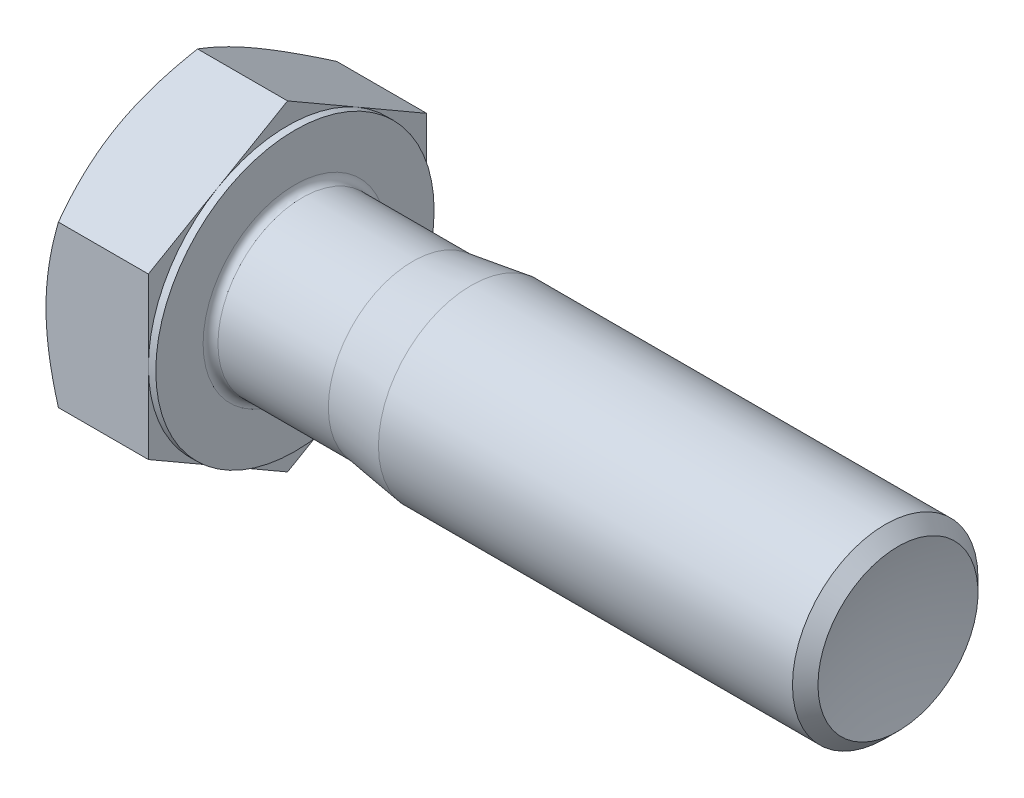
ISO-10303-21;
HEADER;
FILE_DESCRIPTION(('STEP AP214'),'2;1');
FILE_NAME('part.step','',(''),(''),'','','');
FILE_SCHEMA(('AUTOMOTIVE_DESIGN { 1 0 10303 214 1 1 1 1 }'));
ENDSEC;
DATA;
#1=APPLICATION_CONTEXT('core data for automotive mechanical design processes');
#2=APPLICATION_PROTOCOL_DEFINITION('international standard','automotive_design',2000,#1);
#3=PRODUCT_CONTEXT('',#1,'mechanical');
#4=PRODUCT('Part','Part','',(#3));
#5=PRODUCT_RELATED_PRODUCT_CATEGORY('part','',(#4));
#6=PRODUCT_DEFINITION_FORMATION('','',#4);
#7=PRODUCT_DEFINITION_CONTEXT('part definition',#1,'design');
#8=PRODUCT_DEFINITION('design','',#6,#7);
#9=PRODUCT_DEFINITION_SHAPE('','',#8);
#10=(LENGTH_UNIT() NAMED_UNIT(*) SI_UNIT(.MILLI.,.METRE.));
#11=(NAMED_UNIT(*) PLANE_ANGLE_UNIT() SI_UNIT($,.RADIAN.));
#12=(NAMED_UNIT(*) SI_UNIT($,.STERADIAN.) SOLID_ANGLE_UNIT());
#13=UNCERTAINTY_MEASURE_WITH_UNIT(LENGTH_MEASURE(1.E-05),#10,'distance_accuracy_value','');
#14=(GEOMETRIC_REPRESENTATION_CONTEXT(3) GLOBAL_UNCERTAINTY_ASSIGNED_CONTEXT((#13)) GLOBAL_UNIT_ASSIGNED_CONTEXT((#10,
#11,#12)) REPRESENTATION_CONTEXT('',''));
#15=CARTESIAN_POINT('',(0.,0.,0.));
#16=DIRECTION('',(0.,0.,1.));
#17=DIRECTION('',(1.,0.,0.));
#18=AXIS2_PLACEMENT_3D('',#15,#16,#17);
#19=CARTESIAN_POINT('',(12.5,-8.66025403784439,-15.));
#20=DIRECTION('',(-1.,0.,0.));
#21=DIRECTION('',(0.,0.,1.));
#22=AXIS2_PLACEMENT_3D('',#19,#20,#21);
#23=PLANE('',#22);
#24=CARTESIAN_POINT('',(12.5,0.,0.));
#25=DIRECTION('',(-1.,0.,0.));
#26=DIRECTION('',(0.,0.,1.));
#27=AXIS2_PLACEMENT_3D('',#24,#25,#26);
#28=CIRCLE('',#27,9.9);
#29=CARTESIAN_POINT('',(12.5,0.,9.9));
#30=VERTEX_POINT('',#29);
#31=EDGE_CURVE('E11',#30,#30,#28,.T.);
#32=ORIENTED_EDGE('',*,*,#31,.T.);
#33=EDGE_LOOP('',(#32));
#34=FACE_BOUND('',#33,.T.);
#35=CARTESIAN_POINT('',(12.5,0.,0.));
#36=DIRECTION('',(-1.,0.,0.));
#37=DIRECTION('',(0.,0.,1.));
#38=AXIS2_PLACEMENT_3D('',#35,#36,#37);
#39=CIRCLE('',#38,15.);
#40=CARTESIAN_POINT('',(12.5,0.,15.));
#41=VERTEX_POINT('',#40);
#42=EDGE_CURVE('E155',#41,#41,#39,.T.);
#43=ORIENTED_EDGE('',*,*,#42,.F.);
#44=EDGE_LOOP('',(#43));
#45=FACE_BOUND('',#44,.T.);
#46=ADVANCED_FACE('F44',(#34,#45),#23,.F.);
#47=CARTESIAN_POINT('',(0.,0.,0.));
#48=DIRECTION('',(-1.,0.,0.));
#49=DIRECTION('',(0.,0.,1.));
#50=AXIS2_PLACEMENT_3D('',#47,#48,#49);
#51=CYLINDRICAL_SURFACE('',#50,9.1);
#52=CARTESIAN_POINT('',(13.3,0.,0.));
#53=DIRECTION('',(-1.,0.,0.));
#54=DIRECTION('',(0.,0.,1.));
#55=AXIS2_PLACEMENT_3D('',#52,#53,#54);
#56=CIRCLE('',#55,9.1);
#57=CARTESIAN_POINT('',(13.3,0.,9.1));
#58=VERTEX_POINT('',#57);
#59=EDGE_CURVE('E52',#58,#58,#56,.F.);
#60=ORIENTED_EDGE('',*,*,#59,.T.);
#61=EDGE_LOOP('',(#60));
#62=FACE_BOUND('',#61,.T.);
#63=CARTESIAN_POINT('',(25.2,0.,0.));
#64=DIRECTION('',(-1.,0.,0.));
#65=DIRECTION('',(0.,0.,1.));
#66=AXIS2_PLACEMENT_3D('',#63,#64,#65);
#67=CIRCLE('',#66,9.1);
#68=CARTESIAN_POINT('',(25.2,0.,9.1));
#69=VERTEX_POINT('',#68);
#70=EDGE_CURVE('E294',#69,#69,#67,.T.);
#71=ORIENTED_EDGE('',*,*,#70,.T.);
#72=EDGE_LOOP('',(#71));
#73=FACE_BOUND('',#72,.T.);
#74=ADVANCED_FACE('F221',(#62,#73),#51,.T.);
#75=CARTESIAN_POINT('',(114.203938,0.,0.));
#76=DIRECTION('',(0.,0.,1.));
#77=DIRECTION('',(1.,0.,0.));
#78=AXIS2_PLACEMENT_3D('',#75,#76,#77);
#79=SPHERICAL_SURFACE('',#78,37.703938);
#80=CARTESIAN_POINT('',(114.203938,0.,0.));
#81=DIRECTION('',(-1.,0.,0.));
#82=DIRECTION('',(0.,0.,1.));
#83=AXIS2_PLACEMENT_3D('',#80,#81,#82);
#84=SPHERICAL_SURFACE('',#83,37.703938);
#85=CARTESIAN_POINT('',(77.5,0.,0.));
#86=DIRECTION('',(-1.,0.,0.));
#87=DIRECTION('',(0.,0.,1.));
#88=AXIS2_PLACEMENT_3D('',#85,#86,#87);
#89=CIRCLE('',#88,8.626);
#90=CARTESIAN_POINT('',(77.5,0.,8.626));
#91=VERTEX_POINT('',#90);
#92=EDGE_CURVE('E151',#91,#91,#89,.T.);
#93=ORIENTED_EDGE('',*,*,#92,.F.);
#94=EDGE_LOOP('',(#93));
#95=FACE_BOUND('',#94,.T.);
#96=ADVANCED_FACE('F261',(#95),#84,.F.);
#97=CARTESIAN_POINT('',(77.5,0.,0.));
#98=DIRECTION('',(-1.,0.,0.));
#99=DIRECTION('',(0.,0.,1.));
#100=AXIS2_PLACEMENT_3D('',#97,#98,#99);
#101=CONICAL_SURFACE('',#100,8.626,0.785398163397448);
#102=CARTESIAN_POINT('',(76.126,0.,0.));
#103=DIRECTION('',(-1.,0.,0.));
#104=DIRECTION('',(0.,0.,1.));
#105=AXIS2_PLACEMENT_3D('',#102,#103,#104);
#106=CIRCLE('',#105,10.);
#107=CARTESIAN_POINT('',(76.126,0.,10.));
#108=VERTEX_POINT('',#107);
#109=EDGE_CURVE('E160',#108,#108,#106,.T.);
#110=ORIENTED_EDGE('',*,*,#109,.F.);
#111=EDGE_LOOP('',(#110));
#112=FACE_BOUND('',#111,.T.);
#113=ORIENTED_EDGE('',*,*,#92,.T.);
#114=EDGE_LOOP('',(#113));
#115=FACE_BOUND('',#114,.T.);
#116=ADVANCED_FACE('F262',(#112,#115),#101,.T.);
#117=CARTESIAN_POINT('',(0.,0.,0.));
#118=DIRECTION('',(-1.,0.,0.));
#119=DIRECTION('',(0.,0.,1.));
#120=AXIS2_PLACEMENT_3D('',#117,#118,#119);
#121=CYLINDRICAL_SURFACE('',#120,10.);
#122=CARTESIAN_POINT('',(31.5,0.,0.));
#123=DIRECTION('',(-1.,0.,0.));
#124=DIRECTION('',(0.,0.,1.));
#125=AXIS2_PLACEMENT_3D('',#122,#123,#124);
#126=CIRCLE('',#125,9.99999999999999);
#127=CARTESIAN_POINT('',(31.5,0.,9.99999999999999));
#128=VERTEX_POINT('',#127);
#129=EDGE_CURVE('E299',#128,#128,#126,.T.);
#130=ORIENTED_EDGE('',*,*,#129,.F.);
#131=EDGE_LOOP('',(#130));
#132=FACE_BOUND('',#131,.T.);
#133=ORIENTED_EDGE('',*,*,#109,.T.);
#134=EDGE_LOOP('',(#133));
#135=FACE_BOUND('',#134,.T.);
#136=ADVANCED_FACE('F271',(#132,#135),#121,.T.);
#137=CARTESIAN_POINT('',(31.5,0.,0.));
#138=DIRECTION('',(1.,0.,0.));
#139=DIRECTION('',(0.,0.,-1.));
#140=AXIS2_PLACEMENT_3D('',#137,#138,#139);
#141=CONICAL_SURFACE('',#140,9.99999999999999,0.141897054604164);
#142=ORIENTED_EDGE('',*,*,#70,.F.);
#143=EDGE_LOOP('',(#142));
#144=FACE_BOUND('',#143,.T.);
#145=ORIENTED_EDGE('',*,*,#129,.T.);
#146=EDGE_LOOP('',(#145));
#147=FACE_BOUND('',#146,.T.);
#148=ADVANCED_FACE('F284',(#144,#147),#141,.T.);
#149=CARTESIAN_POINT('',(11.7,17.3205080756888,0.));
#150=DIRECTION('',(1.,0.,0.));
#151=DIRECTION('',(0.,0.,-1.));
#152=AXIS2_PLACEMENT_3D('',#149,#150,#151);
#153=PLANE('',#152);
#154=DIRECTION('',(0.,1.,0.));
#155=VECTOR('',#154,1.);
#156=CARTESIAN_POINT('',(11.7,-8.66025403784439,-15.));
#157=LINE('',#156,#155);
#158=CARTESIAN_POINT('',(11.7,-8.6602540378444,-15.));
#159=VERTEX_POINT('',#158);
#160=CARTESIAN_POINT('',(11.7,0.,-15.));
#161=VERTEX_POINT('',#160);
#162=EDGE_CURVE('E176',#159,#161,#157,.T.);
#163=ORIENTED_EDGE('',*,*,#162,.T.);
#164=CARTESIAN_POINT('',(11.7,0.,0.));
#165=DIRECTION('',(-1.,0.,0.));
#166=DIRECTION('',(0.,0.,1.));
#167=AXIS2_PLACEMENT_3D('',#164,#165,#166);
#168=CIRCLE('',#167,15.);
#169=CARTESIAN_POINT('',(11.7,-12.9903810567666,-7.5));
#170=VERTEX_POINT('',#169);
#171=EDGE_CURVE('E58',#161,#170,#168,.T.);
#172=ORIENTED_EDGE('',*,*,#171,.T.);
#173=DIRECTION('',(0.,0.5,-0.866025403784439));
#174=VECTOR('',#173,1.);
#175=CARTESIAN_POINT('',(11.7,-17.3205080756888,0.));
#176=LINE('',#175,#174);
#177=EDGE_CURVE('E158',#170,#159,#176,.T.);
#178=ORIENTED_EDGE('',*,*,#177,.T.);
#179=EDGE_LOOP('',(#163,#172,#178));
#180=FACE_BOUND('',#179,.T.);
#181=ADVANCED_FACE('F180',(#180),#153,.T.);
#182=CARTESIAN_POINT('',(11.7,8.66025403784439,-15.));
#183=VERTEX_POINT('',#182);
#184=EDGE_CURVE('E181',#161,#183,#157,.T.);
#185=ORIENTED_EDGE('',*,*,#184,.T.);
#186=DIRECTION('',(0.,0.5,0.866025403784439));
#187=VECTOR('',#186,1.);
#188=CARTESIAN_POINT('',(11.7,8.66025403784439,-15.));
#189=LINE('',#188,#187);
#190=CARTESIAN_POINT('',(11.7,12.9903810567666,-7.5));
#191=VERTEX_POINT('',#190);
#192=EDGE_CURVE('E189',#183,#191,#189,.T.);
#193=ORIENTED_EDGE('',*,*,#192,.T.);
#194=EDGE_CURVE('E323',#191,#161,#168,.T.);
#195=ORIENTED_EDGE('',*,*,#194,.T.);
#196=EDGE_LOOP('',(#185,#193,#195));
#197=FACE_BOUND('',#196,.T.);
#198=ADVANCED_FACE('F288',(#197),#153,.T.);
#199=CARTESIAN_POINT('',(11.7,17.3205080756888,0.));
#200=VERTEX_POINT('',#199);
#201=EDGE_CURVE('E195',#191,#200,#189,.T.);
#202=ORIENTED_EDGE('',*,*,#201,.T.);
#203=DIRECTION('',(0.,-0.5,0.866025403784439));
#204=VECTOR('',#203,1.);
#205=CARTESIAN_POINT('',(11.7,17.3205080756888,0.));
#206=LINE('',#205,#204);
#207=CARTESIAN_POINT('',(11.7,12.9903810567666,7.5));
#208=VERTEX_POINT('',#207);
#209=EDGE_CURVE('E127',#200,#208,#206,.T.);
#210=ORIENTED_EDGE('',*,*,#209,.T.);
#211=EDGE_CURVE('E322',#208,#191,#168,.T.);
#212=ORIENTED_EDGE('',*,*,#211,.T.);
#213=EDGE_LOOP('',(#202,#210,#212));
#214=FACE_BOUND('',#213,.T.);
#215=ADVANCED_FACE('F328',(#214),#153,.T.);
#216=CARTESIAN_POINT('',(11.7,8.6602540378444,15.));
#217=VERTEX_POINT('',#216);
#218=EDGE_CURVE('E118',#208,#217,#206,.T.);
#219=ORIENTED_EDGE('',*,*,#218,.T.);
#220=DIRECTION('',(0.,-1.,0.));
#221=VECTOR('',#220,1.);
#222=CARTESIAN_POINT('',(11.7,8.66025403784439,15.));
#223=LINE('',#222,#221);
#224=CARTESIAN_POINT('',(11.7,0.,15.));
#225=VERTEX_POINT('',#224);
#226=EDGE_CURVE('E121',#217,#225,#223,.T.);
#227=ORIENTED_EDGE('',*,*,#226,.T.);
#228=EDGE_CURVE('E122',#225,#208,#168,.T.);
#229=ORIENTED_EDGE('',*,*,#228,.T.);
#230=EDGE_LOOP('',(#219,#227,#229));
#231=FACE_BOUND('',#230,.T.);
#232=ADVANCED_FACE('F119',(#231),#153,.T.);
#233=CARTESIAN_POINT('',(11.7,-8.66025403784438,15.));
#234=VERTEX_POINT('',#233);
#235=EDGE_CURVE('E140',#225,#234,#223,.T.);
#236=ORIENTED_EDGE('',*,*,#235,.T.);
#237=DIRECTION('',(0.,-0.5,-0.866025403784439));
#238=VECTOR('',#237,1.);
#239=CARTESIAN_POINT('',(11.7,-8.66025403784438,15.));
#240=LINE('',#239,#238);
#241=CARTESIAN_POINT('',(11.7,-12.9903810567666,7.5));
#242=VERTEX_POINT('',#241);
#243=EDGE_CURVE('E319',#234,#242,#240,.T.);
#244=ORIENTED_EDGE('',*,*,#243,.T.);
#245=EDGE_CURVE('E324',#242,#225,#168,.T.);
#246=ORIENTED_EDGE('',*,*,#245,.T.);
#247=EDGE_LOOP('',(#236,#244,#246));
#248=FACE_BOUND('',#247,.T.);
#249=ADVANCED_FACE('F338',(#248),#153,.T.);
#250=CARTESIAN_POINT('',(11.7,-17.3205080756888,0.));
#251=VERTEX_POINT('',#250);
#252=EDGE_CURVE('E174',#242,#251,#240,.T.);
#253=ORIENTED_EDGE('',*,*,#252,.T.);
#254=EDGE_CURVE('E162',#251,#170,#176,.T.);
#255=ORIENTED_EDGE('',*,*,#254,.T.);
#256=EDGE_CURVE('E171',#170,#242,#168,.T.);
#257=ORIENTED_EDGE('',*,*,#256,.T.);
#258=EDGE_LOOP('',(#253,#255,#257));
#259=FACE_BOUND('',#258,.T.);
#260=ADVANCED_FACE('F169',(#259),#153,.T.);
#261=CARTESIAN_POINT('',(0.,0.,0.));
#262=DIRECTION('',(-1.,0.,0.));
#263=DIRECTION('',(0.,0.,1.));
#264=AXIS2_PLACEMENT_3D('',#261,#262,#263);
#265=CYLINDRICAL_SURFACE('',#264,15.);
#266=ORIENTED_EDGE('',*,*,#171,.F.);
#267=ORIENTED_EDGE('',*,*,#194,.F.);
#268=ORIENTED_EDGE('',*,*,#211,.F.);
#269=ORIENTED_EDGE('',*,*,#228,.F.);
#270=ORIENTED_EDGE('',*,*,#245,.F.);
#271=ORIENTED_EDGE('',*,*,#256,.F.);
#272=EDGE_LOOP('',(#266,#267,#268,#269,#270,#271));
#273=FACE_BOUND('',#272,.T.);
#274=ORIENTED_EDGE('',*,*,#42,.T.);
#275=EDGE_LOOP('',(#274));
#276=FACE_BOUND('',#275,.T.);
#277=ADVANCED_FACE('F330',(#273,#276),#265,.T.);
#278=CARTESIAN_POINT('',(2.5,0.,0.));
#279=DIRECTION('',(-1.,0.,0.));
#280=DIRECTION('',(0.,0.,1.));
#281=AXIS2_PLACEMENT_3D('',#278,#279,#280);
#282=PLANE('',#281);
#283=CARTESIAN_POINT('',(2.5,0.,0.));
#284=DIRECTION('',(-1.,0.,0.));
#285=DIRECTION('',(0.,0.,1.));
#286=AXIS2_PLACEMENT_3D('',#283,#284,#285);
#287=CIRCLE('',#286,13.85);
#288=CARTESIAN_POINT('',(2.5,0.,13.85));
#289=VERTEX_POINT('',#288);
#290=EDGE_CURVE('E190',#289,#289,#287,.T.);
#291=ORIENTED_EDGE('',*,*,#290,.T.);
#292=EDGE_LOOP('',(#291));
#293=FACE_BOUND('',#292,.T.);
#294=ADVANCED_FACE('F336',(#293),#282,.T.);
#295=CARTESIAN_POINT('',(2.5,0.,0.));
#296=DIRECTION('',(-1.,0.,0.));
#297=DIRECTION('',(0.,0.,1.));
#298=AXIS2_PLACEMENT_3D('',#295,#296,#297);
#299=CYLINDRICAL_SURFACE('',#298,13.85);
#300=ORIENTED_EDGE('',*,*,#290,.F.);
#301=EDGE_LOOP('',(#300));
#302=FACE_BOUND('',#301,.T.);
#303=CARTESIAN_POINT('',(0.,0.,0.));
#304=DIRECTION('',(-1.,0.,0.));
#305=DIRECTION('',(0.,0.,1.));
#306=AXIS2_PLACEMENT_3D('',#303,#304,#305);
#307=CIRCLE('',#306,13.85);
#308=CARTESIAN_POINT('',(0.,0.,13.85));
#309=VERTEX_POINT('',#308);
#310=EDGE_CURVE('E185',#309,#309,#307,.T.);
#311=ORIENTED_EDGE('',*,*,#310,.T.);
#312=EDGE_LOOP('',(#311));
#313=FACE_BOUND('',#312,.T.);
#314=ADVANCED_FACE('F218',(#302,#313),#299,.F.);
#315=CARTESIAN_POINT('',(0.,0.,0.));
#316=DIRECTION('',(1.,0.,0.));
#317=DIRECTION('',(0.,0.,-1.));
#318=AXIS2_PLACEMENT_3D('',#315,#316,#317);
#319=CONICAL_SURFACE('',#318,13.85,1.0471975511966);
#320=ORIENTED_EDGE('',*,*,#310,.F.);
#321=EDGE_LOOP('',(#320));
#322=FACE_BOUND('',#321,.T.);
#323=CARTESIAN_POINT('',(7.79742551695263,-22.8763068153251,-15.));
#324=CARTESIAN_POINT('',(7.63861933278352,-22.5473820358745,-15.));
#325=CARTESIAN_POINT('',(7.48064246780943,-22.2180570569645,-15.));
#326=CARTESIAN_POINT('',(7.16653794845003,-21.5585221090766,-15.));
#327=CARTESIAN_POINT('',(7.01041031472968,-21.2283121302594,-15.));
#328=CARTESIAN_POINT('',(6.54504120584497,-20.2361296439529,-15.));
#329=CARTESIAN_POINT('',(6.23886608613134,-19.5727131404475,-15.));
#330=CARTESIAN_POINT('',(5.63491639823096,-18.2374208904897,-15.));
#331=CARTESIAN_POINT('',(5.33720080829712,-17.5655184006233,-15.));
#332=CARTESIAN_POINT('',(4.75468529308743,-16.2161575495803,-15.));
#333=CARTESIAN_POINT('',(4.46988468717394,-15.5386994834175,-15.));
#334=CARTESIAN_POINT('',(3.91344007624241,-14.169170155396,-15.));
#335=CARTESIAN_POINT('',(3.64198779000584,-13.4770205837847,-15.));
#336=CARTESIAN_POINT('',(3.12057296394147,-12.084520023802,-15.));
#337=CARTESIAN_POINT('',(2.87061282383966,-11.3841681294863,-15.));
#338=CARTESIAN_POINT('',(2.39896917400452,-9.97564143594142,-15.));
#339=CARTESIAN_POINT('',(2.17722473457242,-9.26748720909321,-15.));
#340=CARTESIAN_POINT('',(1.76926300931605,-7.84104733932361,-15.));
#341=CARTESIAN_POINT('',(1.58303440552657,-7.12276500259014,-15.));
#342=CARTESIAN_POINT('',(1.33718586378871,-6.03760253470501,-15.));
#343=CARTESIAN_POINT('',(1.26080293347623,-5.67449456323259,-15.));
#344=CARTESIAN_POINT('',(1.12041993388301,-4.94588071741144,-15.));
#345=CARTESIAN_POINT('',(1.05641958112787,-4.58037489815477,-15.));
#346=CARTESIAN_POINT('',(0.941941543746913,-3.84721739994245,-15.));
#347=CARTESIAN_POINT('',(0.891464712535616,-3.47956558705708,-15.));
#348=CARTESIAN_POINT('',(0.805050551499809,-2.74254476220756,-15.));
#349=CARTESIAN_POINT('',(0.769113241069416,-2.37317574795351,-15.));
#350=CARTESIAN_POINT('',(0.712740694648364,-1.63555023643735,-15.));
#351=CARTESIAN_POINT('',(0.692210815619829,-1.26730101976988,-15.));
#352=CARTESIAN_POINT('',(0.66675962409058,-0.530265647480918,-15.));
#353=CARTESIAN_POINT('',(0.661838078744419,-0.161479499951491,-15.));
#354=CARTESIAN_POINT('',(0.667719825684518,0.575869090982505,-15.));
#355=CARTESIAN_POINT('',(0.678518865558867,0.944431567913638,-15.));
#356=CARTESIAN_POINT('',(0.715576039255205,1.68077993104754,-15.));
#357=CARTESIAN_POINT('',(0.741834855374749,2.04856578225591,-15.));
#358=CARTESIAN_POINT('',(0.823919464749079,2.94266916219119,-15.));
#359=CARTESIAN_POINT('',(0.887641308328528,3.46827564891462,-15.));
#360=CARTESIAN_POINT('',(1.04308947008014,4.51530893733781,-15.));
#361=CARTESIAN_POINT('',(1.13482002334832,5.03673509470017,-15.));
#362=CARTESIAN_POINT('',(1.4474163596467,6.59568337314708,-15.));
#363=CARTESIAN_POINT('',(1.70547536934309,7.62583053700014,-15.));
#364=CARTESIAN_POINT('',(2.14966721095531,9.16657782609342,-15.));
#365=CARTESIAN_POINT('',(2.30939063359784,9.68524721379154,-15.));
#366=CARTESIAN_POINT('',(2.64456708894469,10.7175748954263,-15.));
#367=CARTESIAN_POINT('',(2.82002152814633,11.2312327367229,-15.));
#368=CARTESIAN_POINT('',(3.18293630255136,12.2509737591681,-15.));
#369=CARTESIAN_POINT('',(3.37032301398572,12.7570833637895,-15.));
#370=CARTESIAN_POINT('',(3.65942030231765,13.5130712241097,-15.));
#371=CARTESIAN_POINT('',(3.75710586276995,13.7644974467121,-15.));
#372=CARTESIAN_POINT('',(3.95493200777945,14.2663769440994,-15.));
#373=CARTESIAN_POINT('',(4.05507254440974,14.5168302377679,-15.));
#374=CARTESIAN_POINT('',(4.15632947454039,14.766831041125,-15.));
#375=B_SPLINE_CURVE_WITH_KNOTS('',3,(#323,#324,#325,#326,#327,#328,#329,#330,#331,#332,#333,
#334,#335,#336,#337,#338,#339,#340,#341,#342,#343,#344,#345,#346,#347,#348,#349,#350,#351,#352,
#353,#354,#355,#356,#357,#358,#359,#360,#361,#362,#363,#364,#365,#366,#367,#368,#369,#370,#371,
#372,#373,#374),.UNSPECIFIED.,.F.,.F.,(4,2,2,2,2,2,2,2,2,2,2,2,2,2,2,2,2,2,2,2,2,2,2,2,2,4),(0.,
1.09576159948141,2.19153543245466,4.38344490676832,6.58805926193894,8.79255729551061,
11.0227143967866,13.2531201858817,15.4786247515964,17.7034189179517,18.8164064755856,
19.9293685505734,21.0424008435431,22.1554346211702,23.2615741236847,24.3676971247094,
25.4735209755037,26.5793936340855,28.1668549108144,29.754556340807,32.9360988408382,
34.5640910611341,36.1922289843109,37.8111458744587,38.6203432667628,39.42952487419),.UNSPECIFIED.);
#376=CARTESIAN_POINT('',(2.00369877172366,8.66025403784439,-15.));
#377=VERTEX_POINT('',#376);
#378=CARTESIAN_POINT('',(2.00369877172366,-8.66025403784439,-15.));
#379=VERTEX_POINT('',#378);
#380=EDGE_CURVE('E248',#377,#379,#375,.F.);
#381=ORIENTED_EDGE('',*,*,#380,.T.);
#382=CARTESIAN_POINT('',(2.00376543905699,-8.66013856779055,-15.0002));
#383=CARTESIAN_POINT('',(1.89387459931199,-8.85048754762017,-14.6705058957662));
#384=CARTESIAN_POINT('',(1.78897039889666,-9.04157899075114,-14.3395258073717));
#385=CARTESIAN_POINT('',(1.59052139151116,-9.425294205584,-13.674911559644));
#386=CARTESIAN_POINT('',(1.49698032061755,-9.61791845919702,-13.3412765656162));
#387=CARTESIAN_POINT('',(1.32251495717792,-10.0050715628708,-12.6707077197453));
#388=CARTESIAN_POINT('',(1.24162051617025,-10.199603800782,-12.333767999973));
#389=CARTESIAN_POINT('',(1.09418545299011,-10.5900200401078,-11.6575472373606));
#390=CARTESIAN_POINT('',(1.02764401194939,-10.7859039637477,-11.3182663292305));
#391=CARTESIAN_POINT('',(0.911745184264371,-11.1740042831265,-10.6460568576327));
#392=CARTESIAN_POINT('',(0.86200419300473,-11.3661918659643,-10.3131781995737));
#393=CARTESIAN_POINT('',(0.778599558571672,-11.7514476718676,-9.64589556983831));
#394=CARTESIAN_POINT('',(0.744936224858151,-11.9445159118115,-9.31149156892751));
#395=CARTESIAN_POINT('',(0.694536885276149,-12.3309767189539,-8.64212181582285));
#396=CARTESIAN_POINT('',(0.677780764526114,-12.5243686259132,-8.30715720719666));
#397=CARTESIAN_POINT('',(0.661556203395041,-12.9113309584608,-7.636918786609));
#398=CARTESIAN_POINT('',(0.662087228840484,-13.1049013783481,-7.30164498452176));
#399=CARTESIAN_POINT('',(0.679229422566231,-13.4667798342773,-6.6748531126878));
#400=CARTESIAN_POINT('',(0.693749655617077,-13.6351136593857,-6.38329037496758));
#401=CARTESIAN_POINT('',(0.735589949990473,-13.9713941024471,-5.80083556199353));
#402=CARTESIAN_POINT('',(0.762910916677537,-14.1393406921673,-5.50994353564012));
#403=CARTESIAN_POINT('',(0.829876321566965,-14.4747554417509,-4.92898814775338));
#404=CARTESIAN_POINT('',(0.869530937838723,-14.6422230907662,-4.63892567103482));
#405=CARTESIAN_POINT('',(0.960467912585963,-14.9763732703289,-4.06016058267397));
#406=CARTESIAN_POINT('',(1.01175106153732,-15.1430557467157,-3.77145806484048));
#407=CARTESIAN_POINT('',(1.18433967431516,-15.6490296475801,-2.8950855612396));
#408=CARTESIAN_POINT('',(1.32285398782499,-15.9868558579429,-2.30995340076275));
#409=CARTESIAN_POINT('',(1.63722477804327,-16.6574708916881,-1.14841408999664));
#410=CARTESIAN_POINT('',(1.81300742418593,-16.9902683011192,-0.57199206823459));
#411=CARTESIAN_POINT('',(2.00376543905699,-17.3206235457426,0.000199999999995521));
#412=B_SPLINE_CURVE_WITH_KNOTS('',3,(#382,#383,#384,#385,#386,#387,#388,#389,#390,#391,#392,
#393,#394,#395,#396,#397,#398,#399,#400,#401,#402,#403,#404,#405,#406,#407,#408,#409,#410,#411),
.UNSPECIFIED.,.F.,.F.,(4,2,2,2,2,2,2,2,2,2,2,2,2,2,4),(0.,1.18875411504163,2.37789802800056,
3.56980778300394,4.76164951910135,5.92407379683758,7.0865204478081,8.24758247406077,
9.40860862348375,10.4193068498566,11.4300765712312,12.4416826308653,13.4533574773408,
15.5211962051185,17.5849760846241),.UNSPECIFIED.);
#413=CARTESIAN_POINT('',(2.00369877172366,-17.3205080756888,0.));
#414=VERTEX_POINT('',#413);
#415=EDGE_CURVE('E192',#379,#414,#412,.T.);
#416=ORIENTED_EDGE('',*,*,#415,.T.);
#417=CARTESIAN_POINT('',(2.00376543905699,-17.3206235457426,-0.000200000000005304));
#418=CARTESIAN_POINT('',(1.89387459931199,-17.130274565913,0.329494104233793));
#419=CARTESIAN_POINT('',(1.78897039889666,-16.939183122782,0.660474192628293));
#420=CARTESIAN_POINT('',(1.59052139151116,-16.5554679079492,1.32508844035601));
#421=CARTESIAN_POINT('',(1.49698032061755,-16.3628436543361,1.65872343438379));
#422=CARTESIAN_POINT('',(1.32251495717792,-15.9756905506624,2.32929228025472));
#423=CARTESIAN_POINT('',(1.24162051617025,-15.7811583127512,2.666232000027));
#424=CARTESIAN_POINT('',(1.0941854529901,-15.3907420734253,3.34245276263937));
#425=CARTESIAN_POINT('',(1.02764401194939,-15.1948581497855,3.6817336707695));
#426=CARTESIAN_POINT('',(0.911745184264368,-14.8067578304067,4.3539431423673));
#427=CARTESIAN_POINT('',(0.862004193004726,-14.6145702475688,4.68682180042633));
#428=CARTESIAN_POINT('',(0.778599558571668,-14.2293144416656,5.35410443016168));
#429=CARTESIAN_POINT('',(0.744936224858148,-14.0362462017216,5.68850843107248));
#430=CARTESIAN_POINT('',(0.694536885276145,-13.6497853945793,6.35787818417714));
#431=CARTESIAN_POINT('',(0.677780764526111,-13.4563934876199,6.69284279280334));
#432=CARTESIAN_POINT('',(0.661556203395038,-13.0694311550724,7.36308121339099));
#433=CARTESIAN_POINT('',(0.66208722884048,-12.8758607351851,7.69835501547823));
#434=CARTESIAN_POINT('',(0.679229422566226,-12.5139822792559,8.32514688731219));
#435=CARTESIAN_POINT('',(0.693749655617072,-12.3456484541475,8.61670962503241));
#436=CARTESIAN_POINT('',(0.735589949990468,-12.0093680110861,9.19916443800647));
#437=CARTESIAN_POINT('',(0.762910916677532,-11.8414214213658,9.49005646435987));
#438=CARTESIAN_POINT('',(0.82987632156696,-11.5060066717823,10.0710118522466));
#439=CARTESIAN_POINT('',(0.869530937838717,-11.338539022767,10.3610743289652));
#440=CARTESIAN_POINT('',(0.960467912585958,-11.0043888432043,10.939839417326));
#441=CARTESIAN_POINT('',(1.01175106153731,-10.8377063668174,11.2285419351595));
#442=CARTESIAN_POINT('',(1.18433967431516,-10.3317324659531,12.1049144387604));
#443=CARTESIAN_POINT('',(1.32285398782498,-9.99390625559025,12.6900465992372));
#444=CARTESIAN_POINT('',(1.63722477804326,-9.3232912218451,13.8515859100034));
#445=CARTESIAN_POINT('',(1.81300742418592,-8.99049381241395,14.4280079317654));
#446=CARTESIAN_POINT('',(2.00376543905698,-8.66013856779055,15.0002));
#447=B_SPLINE_CURVE_WITH_KNOTS('',3,(#417,#418,#419,#420,#421,#422,#423,#424,#425,#426,#427,
#428,#429,#430,#431,#432,#433,#434,#435,#436,#437,#438,#439,#440,#441,#442,#443,#444,#445,#446),
.UNSPECIFIED.,.F.,.F.,(4,2,2,2,2,2,2,2,2,2,2,2,2,2,4),(0.,1.18875411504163,2.37789802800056,
3.56980778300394,4.76164951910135,5.92407379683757,7.0865204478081,8.24758247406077,
9.40860862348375,10.4193068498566,11.4300765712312,12.4416826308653,13.4533574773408,
15.5211962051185,17.5849760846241),.UNSPECIFIED.);
#448=CARTESIAN_POINT('',(2.00369877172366,-8.66025403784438,15.));
#449=VERTEX_POINT('',#448);
#450=EDGE_CURVE('E203',#414,#449,#447,.T.);
#451=ORIENTED_EDGE('',*,*,#450,.T.);
#452=CARTESIAN_POINT('',(7.79742551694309,-22.8763068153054,15.));
#453=CARTESIAN_POINT('',(7.63861933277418,-22.5473820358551,15.));
#454=CARTESIAN_POINT('',(7.48064246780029,-22.2180570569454,15.));
#455=CARTESIAN_POINT('',(7.16653794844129,-21.5585221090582,15.));
#456=CARTESIAN_POINT('',(7.01041031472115,-21.2283121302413,15.));
#457=CARTESIAN_POINT('',(6.54504120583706,-20.2361296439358,15.));
#458=CARTESIAN_POINT('',(6.23886608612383,-19.5727131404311,15.));
#459=CARTESIAN_POINT('',(5.63491639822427,-18.2374208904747,15.));
#460=CARTESIAN_POINT('',(5.33720080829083,-17.565518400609,15.));
#461=CARTESIAN_POINT('',(4.75468529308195,-16.2161575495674,15.));
#462=CARTESIAN_POINT('',(4.46988468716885,-15.5386994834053,15.));
#463=CARTESIAN_POINT('',(3.91344007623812,-14.1691701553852,15.));
#464=CARTESIAN_POINT('',(3.64198779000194,-13.4770205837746,15.));
#465=CARTESIAN_POINT('',(3.12057296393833,-12.0845200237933,15.));
#466=CARTESIAN_POINT('',(2.87061282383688,-11.3841681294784,15.));
#467=CARTESIAN_POINT('',(2.39896917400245,-9.97564143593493,15.));
#468=CARTESIAN_POINT('',(2.17722473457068,-9.26748720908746,15.));
#469=CARTESIAN_POINT('',(1.76926300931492,-7.84104733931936,15.));
#470=CARTESIAN_POINT('',(1.58303440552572,-7.12276500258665,15.));
#471=CARTESIAN_POINT('',(1.33718586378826,-6.03760253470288,15.));
#472=CARTESIAN_POINT('',(1.26080293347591,-5.67449456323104,15.));
#473=CARTESIAN_POINT('',(1.12041993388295,-4.94588071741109,15.));
#474=CARTESIAN_POINT('',(1.05641958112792,-4.58037489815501,15.));
#475=CARTESIAN_POINT('',(0.941941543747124,-3.84721739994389,15.));
#476=CARTESIAN_POINT('',(0.891464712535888,-3.47956558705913,15.));
#477=CARTESIAN_POINT('',(0.805050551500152,-2.74254476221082,15.));
#478=CARTESIAN_POINT('',(0.76911324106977,-2.37317574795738,15.));
#479=CARTESIAN_POINT('',(0.712740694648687,-1.63555023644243,15.));
#480=CARTESIAN_POINT('',(0.69221081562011,-1.26730101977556,15.));
#481=CARTESIAN_POINT('',(0.666759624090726,-0.530265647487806,15.));
#482=CARTESIAN_POINT('',(0.661838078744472,-0.16147949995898,15.));
#483=CARTESIAN_POINT('',(0.667719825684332,0.575869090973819,15.));
#484=CARTESIAN_POINT('',(0.678518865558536,0.944431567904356,15.));
#485=CARTESIAN_POINT('',(0.715576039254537,1.68077993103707,15.));
#486=CARTESIAN_POINT('',(0.741834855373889,2.04856578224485,15.));
#487=CARTESIAN_POINT('',(0.823919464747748,2.94266916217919,15.));
#488=CARTESIAN_POINT('',(0.887641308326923,3.46827564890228,15.));
#489=CARTESIAN_POINT('',(1.04308947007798,4.51530893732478,15.));
#490=CARTESIAN_POINT('',(1.13482002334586,5.03673509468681,15.));
#491=CARTESIAN_POINT('',(1.44741635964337,6.59568337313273,15.));
#492=CARTESIAN_POINT('',(1.70547536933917,7.62583053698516,15.));
#493=CARTESIAN_POINT('',(2.14966721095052,9.16657782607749,15.));
#494=CARTESIAN_POINT('',(2.30939063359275,9.68524721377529,15.));
#495=CARTESIAN_POINT('',(2.64456708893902,10.7175748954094,15.));
#496=CARTESIAN_POINT('',(2.82002152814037,11.2312327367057,15.));
#497=CARTESIAN_POINT('',(3.18293630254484,12.2509737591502,15.));
#498=CARTESIAN_POINT('',(3.37032301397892,12.7570833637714,15.));
#499=CARTESIAN_POINT('',(3.65942030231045,13.5130712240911,15.));
#500=CARTESIAN_POINT('',(3.75710586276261,13.7644974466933,15.));
#501=CARTESIAN_POINT('',(3.95493200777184,14.2663769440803,15.));
#502=CARTESIAN_POINT('',(4.05507254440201,14.5168302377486,15.));
#503=CARTESIAN_POINT('',(4.15632947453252,14.7668310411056,15.));
#504=B_SPLINE_CURVE_WITH_KNOTS('',3,(#452,#453,#454,#455,#456,#457,#458,#459,#460,#461,#462,
#463,#464,#465,#466,#467,#468,#469,#470,#471,#472,#473,#474,#475,#476,#477,#478,#479,#480,#481,
#482,#483,#484,#485,#486,#487,#488,#489,#490,#491,#492,#493,#494,#495,#496,#497,#498,#499,#500,
#501,#502,#503),.UNSPECIFIED.,.F.,.F.,(4,2,2,2,2,2,2,2,2,2,2,2,2,2,2,2,2,2,2,2,2,2,2,2,2,4),(0.,
1.09576159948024,2.1915354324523,4.3834449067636,6.58805926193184,8.79255729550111,
11.0227143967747,13.2531201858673,15.4786247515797,17.7034189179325,18.8164064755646,
19.9293685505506,21.0424008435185,22.1554346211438,23.2615741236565,24.3676971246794,
25.4735209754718,26.5793936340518,28.1668549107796,29.7545563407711,32.9360988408,
34.5640910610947,36.1922289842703,37.811145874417,38.6203432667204,39.4295248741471),.UNSPECIFIED.);
#505=CARTESIAN_POINT('',(2.00369877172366,8.66025403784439,15.));
#506=VERTEX_POINT('',#505);
#507=EDGE_CURVE('E226',#449,#506,#504,.T.);
#508=ORIENTED_EDGE('',*,*,#507,.T.);
#509=CARTESIAN_POINT('',(2.00376543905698,8.66013856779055,15.0002));
#510=CARTESIAN_POINT('',(1.89387459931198,8.85048754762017,14.6705058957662));
#511=CARTESIAN_POINT('',(1.78897039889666,9.04157899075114,14.3395258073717));
#512=CARTESIAN_POINT('',(1.59052139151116,9.425294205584,13.674911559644));
#513=CARTESIAN_POINT('',(1.49698032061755,9.61791845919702,13.3412765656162));
#514=CARTESIAN_POINT('',(1.32251495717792,10.0050715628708,12.6707077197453));
#515=CARTESIAN_POINT('',(1.24162051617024,10.199603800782,12.333767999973));
#516=CARTESIAN_POINT('',(1.0941854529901,10.5900200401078,11.6575472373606));
#517=CARTESIAN_POINT('',(1.02764401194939,10.7859039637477,11.3182663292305));
#518=CARTESIAN_POINT('',(0.911745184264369,11.1740042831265,10.6460568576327));
#519=CARTESIAN_POINT('',(0.862004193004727,11.3661918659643,10.3131781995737));
#520=CARTESIAN_POINT('',(0.77859955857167,11.7514476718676,9.64589556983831));
#521=CARTESIAN_POINT('',(0.744936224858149,11.9445159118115,9.31149156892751));
#522=CARTESIAN_POINT('',(0.694536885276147,12.3309767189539,8.64212181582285));
#523=CARTESIAN_POINT('',(0.677780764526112,12.5243686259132,8.30715720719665));
#524=CARTESIAN_POINT('',(0.661556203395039,12.9113309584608,7.636918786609));
#525=CARTESIAN_POINT('',(0.662087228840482,13.1049013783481,7.30164498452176));
#526=CARTESIAN_POINT('',(0.679229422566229,13.4667798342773,6.6748531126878));
#527=CARTESIAN_POINT('',(0.693749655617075,13.6351136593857,6.38329037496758));
#528=CARTESIAN_POINT('',(0.735589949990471,13.9713941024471,5.80083556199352));
#529=CARTESIAN_POINT('',(0.762910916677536,14.1393406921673,5.50994353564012));
#530=CARTESIAN_POINT('',(0.829876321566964,14.4747554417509,4.92898814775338));
#531=CARTESIAN_POINT('',(0.86953093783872,14.6422230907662,4.63892567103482));
#532=CARTESIAN_POINT('',(0.960467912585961,14.9763732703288,4.06016058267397));
#533=CARTESIAN_POINT('',(1.01175106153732,15.1430557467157,3.77145806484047));
#534=CARTESIAN_POINT('',(1.18433967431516,15.6490296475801,2.89508556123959));
#535=CARTESIAN_POINT('',(1.32285398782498,15.9868558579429,2.30995340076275));
#536=CARTESIAN_POINT('',(1.63722477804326,16.6574708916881,1.14841408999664));
#537=CARTESIAN_POINT('',(1.81300742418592,16.9902683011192,0.571992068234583));
#538=CARTESIAN_POINT('',(2.00376543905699,17.3206235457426,-0.000200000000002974));
#539=B_SPLINE_CURVE_WITH_KNOTS('',3,(#509,#510,#511,#512,#513,#514,#515,#516,#517,#518,#519,
#520,#521,#522,#523,#524,#525,#526,#527,#528,#529,#530,#531,#532,#533,#534,#535,#536,#537,#538),
.UNSPECIFIED.,.F.,.F.,(4,2,2,2,2,2,2,2,2,2,2,2,2,2,4),(0.,1.18875411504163,2.37789802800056,
3.56980778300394,4.76164951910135,5.92407379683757,7.0865204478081,8.24758247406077,
9.40860862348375,10.4193068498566,11.4300765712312,12.4416826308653,13.4533574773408,
15.5211962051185,17.5849760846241),.UNSPECIFIED.);
#540=CARTESIAN_POINT('',(2.00369877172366,17.3205080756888,0.));
#541=VERTEX_POINT('',#540);
#542=EDGE_CURVE('E145',#506,#541,#539,.T.);
#543=ORIENTED_EDGE('',*,*,#542,.T.);
#544=CARTESIAN_POINT('',(2.00376543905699,17.3206235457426,0.000199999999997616));
#545=CARTESIAN_POINT('',(1.89387459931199,17.130274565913,-0.329494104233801));
#546=CARTESIAN_POINT('',(1.78897039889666,16.939183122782,-0.6604741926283));
#547=CARTESIAN_POINT('',(1.59052139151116,16.5554679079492,-1.32508844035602));
#548=CARTESIAN_POINT('',(1.49698032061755,16.3628436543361,-1.6587234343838));
#549=CARTESIAN_POINT('',(1.32251495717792,15.9756905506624,-2.32929228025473));
#550=CARTESIAN_POINT('',(1.24162051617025,15.7811583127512,-2.66623200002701));
#551=CARTESIAN_POINT('',(1.0941854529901,15.3907420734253,-3.34245276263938));
#552=CARTESIAN_POINT('',(1.02764401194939,15.1948581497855,-3.68173367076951));
#553=CARTESIAN_POINT('',(0.911745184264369,14.8067578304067,-4.35394314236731));
#554=CARTESIAN_POINT('',(0.862004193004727,14.6145702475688,-4.68682180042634));
#555=CARTESIAN_POINT('',(0.778599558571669,14.2293144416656,-5.35410443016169));
#556=CARTESIAN_POINT('',(0.744936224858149,14.0362462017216,-5.68850843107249));
#557=CARTESIAN_POINT('',(0.694536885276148,13.6497853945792,-6.35787818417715));
#558=CARTESIAN_POINT('',(0.677780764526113,13.4563934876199,-6.69284279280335));
#559=CARTESIAN_POINT('',(0.66155620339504,13.0694311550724,-7.363081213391));
#560=CARTESIAN_POINT('',(0.662087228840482,12.8758607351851,-7.69835501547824));
#561=CARTESIAN_POINT('',(0.679229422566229,12.5139822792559,-8.3251468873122));
#562=CARTESIAN_POINT('',(0.693749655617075,12.3456484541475,-8.61670962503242));
#563=CARTESIAN_POINT('',(0.735589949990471,12.0093680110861,-9.19916443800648));
#564=CARTESIAN_POINT('',(0.762910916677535,11.8414214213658,-9.49005646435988));
#565=CARTESIAN_POINT('',(0.829876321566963,11.5060066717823,-10.0710118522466));
#566=CARTESIAN_POINT('',(0.86953093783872,11.338539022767,-10.3610743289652));
#567=CARTESIAN_POINT('',(0.960467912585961,11.0043888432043,-10.939839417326));
#568=CARTESIAN_POINT('',(1.01175106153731,10.8377063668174,-11.2285419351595));
#569=CARTESIAN_POINT('',(1.18433967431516,10.3317324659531,-12.1049144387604));
#570=CARTESIAN_POINT('',(1.32285398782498,9.99390625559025,-12.6900465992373));
#571=CARTESIAN_POINT('',(1.63722477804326,9.32329122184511,-13.8515859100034));
#572=CARTESIAN_POINT('',(1.81300742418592,8.99049381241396,-14.4280079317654));
#573=CARTESIAN_POINT('',(2.00376543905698,8.66013856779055,-15.0002));
#574=B_SPLINE_CURVE_WITH_KNOTS('',3,(#544,#545,#546,#547,#548,#549,#550,#551,#552,#553,#554,
#555,#556,#557,#558,#559,#560,#561,#562,#563,#564,#565,#566,#567,#568,#569,#570,#571,#572,#573),
.UNSPECIFIED.,.F.,.F.,(4,2,2,2,2,2,2,2,2,2,2,2,2,2,4),(0.,1.18875411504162,2.37789802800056,
3.56980778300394,4.76164951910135,5.92407379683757,7.0865204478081,8.24758247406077,
9.40860862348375,10.4193068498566,11.4300765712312,12.4416826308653,13.4533574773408,
15.5211962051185,17.5849760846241),.UNSPECIFIED.);
#575=EDGE_CURVE('E245',#541,#377,#574,.T.);
#576=ORIENTED_EDGE('',*,*,#575,.T.);
#577=EDGE_LOOP('',(#381,#416,#451,#508,#543,#576));
#578=FACE_BOUND('',#577,.T.);
#579=ADVANCED_FACE('F214',(#322,#578),#319,.T.);
#580=CARTESIAN_POINT('',(12.5,-17.3205080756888,0.));
#581=DIRECTION('',(0.,0.866025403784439,0.5));
#582=DIRECTION('',(0.,-0.5,0.866025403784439));
#583=AXIS2_PLACEMENT_3D('',#580,#581,#582);
#584=PLANE('',#583);
#585=ORIENTED_EDGE('',*,*,#254,.F.);
#586=DIRECTION('',(-1.,0.,0.));
#587=VECTOR('',#586,1.);
#588=CARTESIAN_POINT('',(12.5,-17.3205080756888,0.));
#589=LINE('',#588,#587);
#590=EDGE_CURVE('E149',#251,#414,#589,.T.);
#591=ORIENTED_EDGE('',*,*,#590,.T.);
#592=ORIENTED_EDGE('',*,*,#415,.F.);
#593=DIRECTION('',(-1.,0.,0.));
#594=VECTOR('',#593,1.);
#595=CARTESIAN_POINT('',(12.5,-8.66025403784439,-15.));
#596=LINE('',#595,#594);
#597=EDGE_CURVE('E68',#159,#379,#596,.T.);
#598=ORIENTED_EDGE('',*,*,#597,.F.);
#599=ORIENTED_EDGE('',*,*,#177,.F.);
#600=EDGE_LOOP('',(#585,#591,#592,#598,#599));
#601=FACE_BOUND('',#600,.T.);
#602=ADVANCED_FACE('F177',(#601),#584,.F.);
#603=CARTESIAN_POINT('',(12.5,-8.66025403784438,15.));
#604=DIRECTION('',(0.,0.866025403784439,-0.5));
#605=DIRECTION('',(0.,0.5,0.866025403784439));
#606=AXIS2_PLACEMENT_3D('',#603,#604,#605);
#607=PLANE('',#606);
#608=ORIENTED_EDGE('',*,*,#243,.F.);
#609=DIRECTION('',(-1.,0.,0.));
#610=VECTOR('',#609,1.);
#611=CARTESIAN_POINT('',(12.5,-8.66025403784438,15.));
#612=LINE('',#611,#610);
#613=EDGE_CURVE('E142',#234,#449,#612,.T.);
#614=ORIENTED_EDGE('',*,*,#613,.T.);
#615=ORIENTED_EDGE('',*,*,#450,.F.);
#616=ORIENTED_EDGE('',*,*,#590,.F.);
#617=ORIENTED_EDGE('',*,*,#252,.F.);
#618=EDGE_LOOP('',(#608,#614,#615,#616,#617));
#619=FACE_BOUND('',#618,.T.);
#620=ADVANCED_FACE('F306',(#619),#607,.F.);
#621=CARTESIAN_POINT('',(12.5,8.66025403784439,15.));
#622=DIRECTION('',(0.,0.,-1.));
#623=DIRECTION('',(-1.,0.,0.));
#624=AXIS2_PLACEMENT_3D('',#621,#622,#623);
#625=PLANE('',#624);
#626=ORIENTED_EDGE('',*,*,#226,.F.);
#627=DIRECTION('',(-1.,0.,0.));
#628=VECTOR('',#627,1.);
#629=CARTESIAN_POINT('',(12.5,8.66025403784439,15.));
#630=LINE('',#629,#628);
#631=EDGE_CURVE('E131',#217,#506,#630,.T.);
#632=ORIENTED_EDGE('',*,*,#631,.T.);
#633=ORIENTED_EDGE('',*,*,#507,.F.);
#634=ORIENTED_EDGE('',*,*,#613,.F.);
#635=ORIENTED_EDGE('',*,*,#235,.F.);
#636=EDGE_LOOP('',(#626,#632,#633,#634,#635));
#637=FACE_BOUND('',#636,.T.);
#638=ADVANCED_FACE('F135',(#637),#625,.F.);
#639=CARTESIAN_POINT('',(12.5,17.3205080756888,0.));
#640=DIRECTION('',(0.,-0.866025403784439,-0.5));
#641=DIRECTION('',(0.,0.5,-0.866025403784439));
#642=AXIS2_PLACEMENT_3D('',#639,#640,#641);
#643=PLANE('',#642);
#644=ORIENTED_EDGE('',*,*,#209,.F.);
#645=DIRECTION('',(-1.,0.,0.));
#646=VECTOR('',#645,1.);
#647=CARTESIAN_POINT('',(12.5,17.3205080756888,0.));
#648=LINE('',#647,#646);
#649=EDGE_CURVE('E143',#200,#541,#648,.T.);
#650=ORIENTED_EDGE('',*,*,#649,.T.);
#651=ORIENTED_EDGE('',*,*,#542,.F.);
#652=ORIENTED_EDGE('',*,*,#631,.F.);
#653=ORIENTED_EDGE('',*,*,#218,.F.);
#654=EDGE_LOOP('',(#644,#650,#651,#652,#653));
#655=FACE_BOUND('',#654,.T.);
#656=ADVANCED_FACE('F138',(#655),#643,.F.);
#657=CARTESIAN_POINT('',(12.5,8.66025403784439,-15.));
#658=DIRECTION('',(0.,-0.866025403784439,0.5));
#659=DIRECTION('',(0.,-0.5,-0.866025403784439));
#660=AXIS2_PLACEMENT_3D('',#657,#658,#659);
#661=PLANE('',#660);
#662=ORIENTED_EDGE('',*,*,#192,.F.);
#663=DIRECTION('',(-1.,0.,0.));
#664=VECTOR('',#663,1.);
#665=CARTESIAN_POINT('',(12.5,8.66025403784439,-15.));
#666=LINE('',#665,#664);
#667=EDGE_CURVE('E146',#183,#377,#666,.T.);
#668=ORIENTED_EDGE('',*,*,#667,.T.);
#669=ORIENTED_EDGE('',*,*,#575,.F.);
#670=ORIENTED_EDGE('',*,*,#649,.F.);
#671=ORIENTED_EDGE('',*,*,#201,.F.);
#672=EDGE_LOOP('',(#662,#668,#669,#670,#671));
#673=FACE_BOUND('',#672,.T.);
#674=ADVANCED_FACE('F258',(#673),#661,.F.);
#675=CARTESIAN_POINT('',(12.5,-8.66025403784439,-15.));
#676=DIRECTION('',(0.,0.,1.));
#677=DIRECTION('',(0.,-1.,0.));
#678=AXIS2_PLACEMENT_3D('',#675,#676,#677);
#679=PLANE('',#678);
#680=ORIENTED_EDGE('',*,*,#162,.F.);
#681=ORIENTED_EDGE('',*,*,#597,.T.);
#682=ORIENTED_EDGE('',*,*,#380,.F.);
#683=ORIENTED_EDGE('',*,*,#667,.F.);
#684=ORIENTED_EDGE('',*,*,#184,.F.);
#685=EDGE_LOOP('',(#680,#681,#682,#683,#684));
#686=FACE_BOUND('',#685,.T.);
#687=ADVANCED_FACE('F183',(#686),#679,.F.);
#688=CARTESIAN_POINT('',(13.3,0.,0.));
#689=DIRECTION('',(-1.,0.,0.));
#690=DIRECTION('',(0.,0.,1.));
#691=AXIS2_PLACEMENT_3D('',#688,#689,#690);
#692=TOROIDAL_SURFACE('',#691,9.9,0.8);
#693=ORIENTED_EDGE('',*,*,#31,.F.);
#694=EDGE_LOOP('',(#693));
#695=FACE_BOUND('',#694,.T.);
#696=ORIENTED_EDGE('',*,*,#59,.F.);
#697=EDGE_LOOP('',(#696));
#698=FACE_BOUND('',#697,.T.);
#699=ADVANCED_FACE('F50',(#695,#698),#692,.F.);
#700=CLOSED_SHELL('',(#46,#74,#96,#116,#136,#148,#181,#198,#215,#232,#249,#260,#277,#294,#314,
#579,#602,#620,#638,#656,#674,#687,#699));
#701=MANIFOLD_SOLID_BREP('B2',#700);
#702=ADVANCED_BREP_SHAPE_REPRESENTATION('',(#18,#701),#14);
#703=SHAPE_DEFINITION_REPRESENTATION(#9,#702);
ENDSEC;
END-ISO-10303-21;
